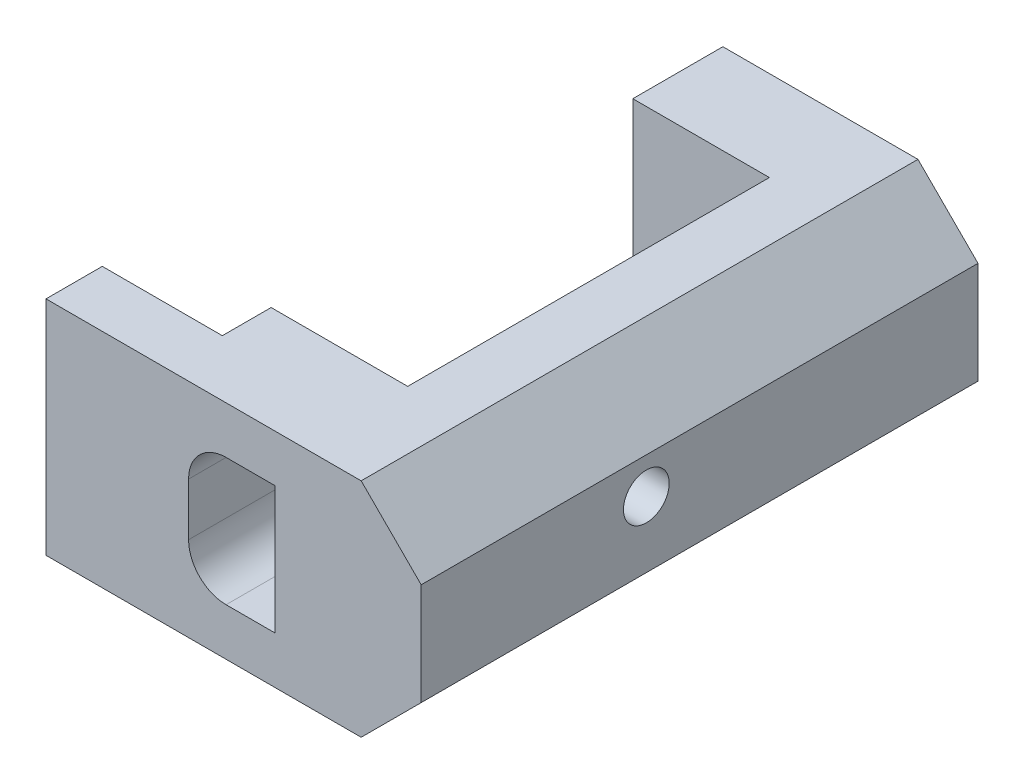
ISO-10303-21;
HEADER;
FILE_DESCRIPTION(('STEP AP214'),'2;1');
FILE_NAME('part.step','',(''),(''),'','','');
FILE_SCHEMA(('AUTOMOTIVE_DESIGN { 1 0 10303 214 1 1 1 1 }'));
ENDSEC;
DATA;
#1=APPLICATION_CONTEXT('core data for automotive mechanical design processes');
#2=APPLICATION_PROTOCOL_DEFINITION('international standard','automotive_design',2000,#1);
#3=PRODUCT_CONTEXT('',#1,'mechanical');
#4=PRODUCT('Part','Part','',(#3));
#5=PRODUCT_RELATED_PRODUCT_CATEGORY('part','',(#4));
#6=PRODUCT_DEFINITION_FORMATION('','',#4);
#7=PRODUCT_DEFINITION_CONTEXT('part definition',#1,'design');
#8=PRODUCT_DEFINITION('design','',#6,#7);
#9=PRODUCT_DEFINITION_SHAPE('','',#8);
#10=(LENGTH_UNIT() NAMED_UNIT(*) SI_UNIT(.MILLI.,.METRE.));
#11=(NAMED_UNIT(*) PLANE_ANGLE_UNIT() SI_UNIT($,.RADIAN.));
#12=(NAMED_UNIT(*) SI_UNIT($,.STERADIAN.) SOLID_ANGLE_UNIT());
#13=UNCERTAINTY_MEASURE_WITH_UNIT(LENGTH_MEASURE(1.E-05),#10,'distance_accuracy_value','');
#14=(GEOMETRIC_REPRESENTATION_CONTEXT(3) GLOBAL_UNCERTAINTY_ASSIGNED_CONTEXT((#13)) GLOBAL_UNIT_ASSIGNED_CONTEXT((#10,
#11,#12)) REPRESENTATION_CONTEXT('',''));
#15=CARTESIAN_POINT('',(0.,0.,0.));
#16=DIRECTION('',(0.,0.,1.));
#17=DIRECTION('',(1.,0.,0.));
#18=AXIS2_PLACEMENT_3D('',#15,#16,#17);
#19=CARTESIAN_POINT('',(0.,14.8,0.));
#20=DIRECTION('',(1.,0.,0.));
#21=DIRECTION('',(0.,0.,-1.));
#22=AXIS2_PLACEMENT_3D('',#19,#20,#21);
#23=PLANE('',#22);
#24=DIRECTION('',(0.,0.,1.));
#25=VECTOR('',#24,1.);
#26=CARTESIAN_POINT('',(0.,14.8,0.));
#27=LINE('',#26,#25);
#28=CARTESIAN_POINT('',(0.,14.8,-4.));
#29=VERTEX_POINT('',#28);
#30=CARTESIAN_POINT('',(0.,14.8,-0.750000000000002));
#31=VERTEX_POINT('',#30);
#32=EDGE_CURVE('E362',#29,#31,#27,.T.);
#33=ORIENTED_EDGE('',*,*,#32,.F.);
#34=DIRECTION('',(0.,1.,0.));
#35=VECTOR('',#34,1.);
#36=CARTESIAN_POINT('',(0.,14.8,-4.));
#37=LINE('',#36,#35);
#38=CARTESIAN_POINT('',(0.,0.,-4.));
#39=VERTEX_POINT('',#38);
#40=EDGE_CURVE('E220',#39,#29,#37,.T.);
#41=ORIENTED_EDGE('',*,*,#40,.F.);
#42=DIRECTION('',(0.,0.,1.));
#43=VECTOR('',#42,1.);
#44=CARTESIAN_POINT('',(0.,0.,0.));
#45=LINE('',#44,#43);
#46=CARTESIAN_POINT('',(0.,0.,-0.750000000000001));
#47=VERTEX_POINT('',#46);
#48=EDGE_CURVE('E351',#39,#47,#45,.T.);
#49=ORIENTED_EDGE('',*,*,#48,.T.);
#50=DIRECTION('',(0.,1.,0.));
#51=VECTOR('',#50,1.);
#52=CARTESIAN_POINT('',(0.,0.,-0.750000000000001));
#53=LINE('',#52,#51);
#54=EDGE_CURVE('E280',#47,#31,#53,.T.);
#55=ORIENTED_EDGE('',*,*,#54,.T.);
#56=EDGE_LOOP('',(#33,#41,#49,#55));
#57=FACE_BOUND('',#56,.T.);
#58=ADVANCED_FACE('F34',(#57),#23,.F.);
#59=CARTESIAN_POINT('',(0.,14.8,-33.1));
#60=DIRECTION('',(1.,0.,0.));
#61=DIRECTION('',(0.,0.,-1.));
#62=AXIS2_PLACEMENT_3D('',#59,#60,#61);
#63=PLANE('',#62);
#64=CARTESIAN_POINT('',(1.01164552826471E-13,8.4,-31.1));
#65=DIRECTION('',(-1.,0.,0.));
#66=DIRECTION('',(0.,0.,1.));
#67=AXIS2_PLACEMENT_3D('',#64,#65,#66);
#68=CIRCLE('',#67,1.);
#69=CARTESIAN_POINT('',(0.,8.4,-30.1));
#70=VERTEX_POINT('',#69);
#71=EDGE_CURVE('E245',#70,#70,#68,.T.);
#72=ORIENTED_EDGE('',*,*,#71,.F.);
#73=EDGE_LOOP('',(#72));
#74=FACE_BOUND('',#73,.T.);
#75=DIRECTION('',(0.,0.,1.));
#76=VECTOR('',#75,1.);
#77=CARTESIAN_POINT('',(0.,0.,-33.1));
#78=LINE('',#77,#76);
#79=CARTESIAN_POINT('',(0.,0.,-34.1));
#80=VERTEX_POINT('',#79);
#81=CARTESIAN_POINT('',(0.,0.,-28.1));
#82=VERTEX_POINT('',#81);
#83=EDGE_CURVE('E368',#80,#82,#78,.T.);
#84=ORIENTED_EDGE('',*,*,#83,.T.);
#85=DIRECTION('',(0.,-1.,0.));
#86=VECTOR('',#85,1.);
#87=CARTESIAN_POINT('',(0.,14.8,-28.1));
#88=LINE('',#87,#86);
#89=CARTESIAN_POINT('',(0.,14.8,-28.1));
#90=VERTEX_POINT('',#89);
#91=EDGE_CURVE('E374',#90,#82,#88,.T.);
#92=ORIENTED_EDGE('',*,*,#91,.F.);
#93=DIRECTION('',(0.,0.,1.));
#94=VECTOR('',#93,1.);
#95=CARTESIAN_POINT('',(0.,14.8,-33.1));
#96=LINE('',#95,#94);
#97=CARTESIAN_POINT('',(0.,14.8,-34.1));
#98=VERTEX_POINT('',#97);
#99=EDGE_CURVE('E364',#98,#90,#96,.T.);
#100=ORIENTED_EDGE('',*,*,#99,.F.);
#101=DIRECTION('',(0.,1.,0.));
#102=VECTOR('',#101,1.);
#103=CARTESIAN_POINT('',(0.,0.,-34.1));
#104=LINE('',#103,#102);
#105=EDGE_CURVE('E253',#80,#98,#104,.T.);
#106=ORIENTED_EDGE('',*,*,#105,.F.);
#107=EDGE_LOOP('',(#84,#92,#100,#106));
#108=FACE_BOUND('',#107,.T.);
#109=ADVANCED_FACE('F411',(#74,#108),#63,.F.);
#110=CARTESIAN_POINT('',(0.,14.8,-28.1));
#111=DIRECTION('',(0.,0.,-1.));
#112=DIRECTION('',(-1.,0.,0.));
#113=AXIS2_PLACEMENT_3D('',#110,#111,#112);
#114=PLANE('',#113);
#115=DIRECTION('',(1.,0.,0.));
#116=VECTOR('',#115,1.);
#117=CARTESIAN_POINT('',(0.,0.,-28.1));
#118=LINE('',#117,#116);
#119=CARTESIAN_POINT('',(9.09999999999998,0.,-28.1));
#120=VERTEX_POINT('',#119);
#121=EDGE_CURVE('E370',#82,#120,#118,.T.);
#122=ORIENTED_EDGE('',*,*,#121,.T.);
#123=DIRECTION('',(0.,-1.,0.));
#124=VECTOR('',#123,1.);
#125=CARTESIAN_POINT('',(9.09999999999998,14.8,-28.1));
#126=LINE('',#125,#124);
#127=CARTESIAN_POINT('',(9.09999999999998,14.8,-28.1));
#128=VERTEX_POINT('',#127);
#129=EDGE_CURVE('E206',#128,#120,#126,.T.);
#130=ORIENTED_EDGE('',*,*,#129,.F.);
#131=DIRECTION('',(1.,0.,0.));
#132=VECTOR('',#131,1.);
#133=CARTESIAN_POINT('',(0.,14.8,-28.1));
#134=LINE('',#133,#132);
#135=EDGE_CURVE('E202',#90,#128,#134,.T.);
#136=ORIENTED_EDGE('',*,*,#135,.F.);
#137=ORIENTED_EDGE('',*,*,#91,.T.);
#138=EDGE_LOOP('',(#122,#130,#136,#137));
#139=FACE_BOUND('',#138,.T.);
#140=ADVANCED_FACE('F431',(#139),#114,.F.);
#141=CARTESIAN_POINT('',(9.09999999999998,14.8,-5.));
#142=DIRECTION('',(1.,0.,0.));
#143=DIRECTION('',(0.,0.,-1.));
#144=AXIS2_PLACEMENT_3D('',#141,#142,#143);
#145=PLANE('',#144);
#146=DIRECTION('',(0.,-0.429835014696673,-0.902907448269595));
#147=VECTOR('',#146,1.);
#148=CARTESIAN_POINT('',(9.09999999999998,11.6896323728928,-11.7386212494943));
#149=LINE('',#148,#147);
#150=CARTESIAN_POINT('',(9.09999999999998,11.6896323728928,-11.7386212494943));
#151=VERTEX_POINT('',#150);
#152=CARTESIAN_POINT('',(9.09999999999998,10.2711768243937,-14.718215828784));
#153=VERTEX_POINT('',#152);
#154=EDGE_CURVE('E335',#151,#153,#149,.T.);
#155=ORIENTED_EDGE('',*,*,#154,.F.);
#156=DIRECTION('',(0.,0.567023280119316,-0.823701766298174));
#157=VECTOR('',#156,1.);
#158=CARTESIAN_POINT('',(9.09999999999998,9.81845554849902,-9.02040542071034));
#159=LINE('',#158,#157);
#160=CARTESIAN_POINT('',(9.09999999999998,9.81845554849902,-9.02040542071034));
#161=VERTEX_POINT('',#160);
#162=EDGE_CURVE('E313',#161,#151,#159,.T.);
#163=ORIENTED_EDGE('',*,*,#162,.F.);
#164=DIRECTION('',(0.,0.996858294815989,0.0792056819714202));
#165=VECTOR('',#164,1.);
#166=CARTESIAN_POINT('',(9.09999999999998,6.52882317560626,-9.28178417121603));
#167=LINE('',#166,#165);
#168=CARTESIAN_POINT('',(9.09999999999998,6.52882317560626,-9.28178417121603));
#169=VERTEX_POINT('',#168);
#170=EDGE_CURVE('E318',#169,#161,#167,.T.);
#171=ORIENTED_EDGE('',*,*,#170,.F.);
#172=DIRECTION('',(0.,0.429835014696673,0.902907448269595));
#173=VECTOR('',#172,1.);
#174=CARTESIAN_POINT('',(9.09999999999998,5.11036762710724,-12.2613787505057));
#175=LINE('',#174,#173);
#176=CARTESIAN_POINT('',(9.09999999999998,5.11036762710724,-12.2613787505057));
#177=VERTEX_POINT('',#176);
#178=EDGE_CURVE('E344',#177,#169,#175,.T.);
#179=ORIENTED_EDGE('',*,*,#178,.F.);
#180=DIRECTION('',(0.,-0.567023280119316,0.823701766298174));
#181=VECTOR('',#180,1.);
#182=CARTESIAN_POINT('',(9.09999999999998,6.98154445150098,-14.9795945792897));
#183=LINE('',#182,#181);
#184=CARTESIAN_POINT('',(9.09999999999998,6.98154445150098,-14.9795945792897));
#185=VERTEX_POINT('',#184);
#186=EDGE_CURVE('E341',#185,#177,#183,.T.);
#187=ORIENTED_EDGE('',*,*,#186,.F.);
#188=DIRECTION('',(0.,-0.99685829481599,-0.0792056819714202));
#189=VECTOR('',#188,1.);
#190=CARTESIAN_POINT('',(9.09999999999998,10.2711768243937,-14.718215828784));
#191=LINE('',#190,#189);
#192=EDGE_CURVE('E338',#153,#185,#191,.T.);
#193=ORIENTED_EDGE('',*,*,#192,.F.);
#194=EDGE_LOOP('',(#155,#163,#171,#179,#187,#193));
#195=FACE_BOUND('',#194,.T.);
#196=DIRECTION('',(0.,0.,1.));
#197=VECTOR('',#196,1.);
#198=CARTESIAN_POINT('',(9.09999999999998,0.,-5.));
#199=LINE('',#198,#197);
#200=CARTESIAN_POINT('',(9.09999999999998,0.,-4.));
#201=VERTEX_POINT('',#200);
#202=EDGE_CURVE('E212',#120,#201,#199,.T.);
#203=ORIENTED_EDGE('',*,*,#202,.T.);
#204=DIRECTION('',(0.,-1.,0.));
#205=VECTOR('',#204,1.);
#206=CARTESIAN_POINT('',(9.09999999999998,0.,-4.));
#207=LINE('',#206,#205);
#208=CARTESIAN_POINT('',(9.09999999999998,14.8,-4.));
#209=VERTEX_POINT('',#208);
#210=EDGE_CURVE('E209',#209,#201,#207,.T.);
#211=ORIENTED_EDGE('',*,*,#210,.F.);
#212=DIRECTION('',(0.,0.,1.));
#213=VECTOR('',#212,1.);
#214=CARTESIAN_POINT('',(9.09999999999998,14.8,-5.));
#215=LINE('',#214,#213);
#216=EDGE_CURVE('E195',#128,#209,#215,.T.);
#217=ORIENTED_EDGE('',*,*,#216,.F.);
#218=ORIENTED_EDGE('',*,*,#129,.T.);
#219=EDGE_LOOP('',(#203,#211,#217,#218));
#220=FACE_BOUND('',#219,.T.);
#221=ADVANCED_FACE('F210',(#195,#220),#145,.F.);
#222=CARTESIAN_POINT('',(0.,14.8,0.));
#223=DIRECTION('',(0.,-1.,0.));
#224=DIRECTION('',(0.,0.,-1.));
#225=AXIS2_PLACEMENT_3D('',#222,#223,#224);
#226=PLANE('',#225);
#227=DIRECTION('',(-1.,0.,0.));
#228=VECTOR('',#227,1.);
#229=CARTESIAN_POINT('',(0.,14.8,3.));
#230=LINE('',#229,#228);
#231=CARTESIAN_POINT('',(13.,14.8,3.));
#232=VERTEX_POINT('',#231);
#233=CARTESIAN_POINT('',(-7.99999999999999,14.8,3.00000000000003));
#234=VERTEX_POINT('',#233);
#235=EDGE_CURVE('E309',#232,#234,#230,.T.);
#236=ORIENTED_EDGE('',*,*,#235,.F.);
#237=DIRECTION('',(0.,0.,-1.));
#238=VECTOR('',#237,1.);
#239=CARTESIAN_POINT('',(13.,14.8,0.));
#240=LINE('',#239,#238);
#241=CARTESIAN_POINT('',(13.,14.8,-34.1));
#242=VERTEX_POINT('',#241);
#243=EDGE_CURVE('E11',#232,#242,#240,.T.);
#244=ORIENTED_EDGE('',*,*,#243,.T.);
#245=DIRECTION('',(1.,0.,0.));
#246=VECTOR('',#245,1.);
#247=CARTESIAN_POINT('',(0.,14.8,-34.1));
#248=LINE('',#247,#246);
#249=EDGE_CURVE('E256',#98,#242,#248,.T.);
#250=ORIENTED_EDGE('',*,*,#249,.F.);
#251=ORIENTED_EDGE('',*,*,#99,.T.);
#252=ORIENTED_EDGE('',*,*,#135,.T.);
#253=ORIENTED_EDGE('',*,*,#216,.T.);
#254=DIRECTION('',(1.,0.,0.));
#255=VECTOR('',#254,1.);
#256=CARTESIAN_POINT('',(9.09999999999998,14.8,-4.));
#257=LINE('',#256,#255);
#258=EDGE_CURVE('E199',#29,#209,#257,.T.);
#259=ORIENTED_EDGE('',*,*,#258,.F.);
#260=ORIENTED_EDGE('',*,*,#32,.T.);
#261=DIRECTION('',(1.,0.,0.));
#262=VECTOR('',#261,1.);
#263=CARTESIAN_POINT('',(-8.,14.8,-0.749999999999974));
#264=LINE('',#263,#262);
#265=CARTESIAN_POINT('',(-8.,14.8,-0.749999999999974));
#266=VERTEX_POINT('',#265);
#267=EDGE_CURVE('E301',#266,#31,#264,.T.);
#268=ORIENTED_EDGE('',*,*,#267,.F.);
#269=DIRECTION('',(0.,0.,-1.));
#270=VECTOR('',#269,1.);
#271=CARTESIAN_POINT('',(-8.,14.8,0.));
#272=LINE('',#271,#270);
#273=EDGE_CURVE('E299',#234,#266,#272,.T.);
#274=ORIENTED_EDGE('',*,*,#273,.F.);
#275=EDGE_LOOP('',(#236,#244,#250,#251,#252,#253,#259,#260,#268,#274));
#276=FACE_BOUND('',#275,.T.);
#277=ADVANCED_FACE('F197',(#276),#226,.F.);
#278=CARTESIAN_POINT('',(0.,0.,0.));
#279=DIRECTION('',(0.,-1.,0.));
#280=DIRECTION('',(0.,0.,-1.));
#281=AXIS2_PLACEMENT_3D('',#278,#279,#280);
#282=PLANE('',#281);
#283=DIRECTION('',(-1.,0.,0.));
#284=VECTOR('',#283,1.);
#285=CARTESIAN_POINT('',(0.,0.,-34.1));
#286=LINE('',#285,#284);
#287=CARTESIAN_POINT('',(13.,0.,-34.1));
#288=VERTEX_POINT('',#287);
#289=EDGE_CURVE('E249',#288,#80,#286,.T.);
#290=ORIENTED_EDGE('',*,*,#289,.F.);
#291=DIRECTION('',(0.,0.,1.));
#292=VECTOR('',#291,1.);
#293=CARTESIAN_POINT('',(13.,0.,3.));
#294=LINE('',#293,#292);
#295=CARTESIAN_POINT('',(13.,0.,3.));
#296=VERTEX_POINT('',#295);
#297=EDGE_CURVE('E57',#288,#296,#294,.T.);
#298=ORIENTED_EDGE('',*,*,#297,.T.);
#299=DIRECTION('',(1.,0.,0.));
#300=VECTOR('',#299,1.);
#301=CARTESIAN_POINT('',(0.,0.,3.));
#302=LINE('',#301,#300);
#303=CARTESIAN_POINT('',(-7.99999999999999,0.,3.00000000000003));
#304=VERTEX_POINT('',#303);
#305=EDGE_CURVE('E311',#304,#296,#302,.T.);
#306=ORIENTED_EDGE('',*,*,#305,.F.);
#307=DIRECTION('',(0.,0.,1.));
#308=VECTOR('',#307,1.);
#309=CARTESIAN_POINT('',(-8.,0.,0.));
#310=LINE('',#309,#308);
#311=CARTESIAN_POINT('',(-8.,0.,-0.749999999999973));
#312=VERTEX_POINT('',#311);
#313=EDGE_CURVE('E293',#312,#304,#310,.T.);
#314=ORIENTED_EDGE('',*,*,#313,.F.);
#315=DIRECTION('',(1.,0.,0.));
#316=VECTOR('',#315,1.);
#317=CARTESIAN_POINT('',(-8.,0.,-0.749999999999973));
#318=LINE('',#317,#316);
#319=EDGE_CURVE('E306',#312,#47,#318,.T.);
#320=ORIENTED_EDGE('',*,*,#319,.T.);
#321=ORIENTED_EDGE('',*,*,#48,.F.);
#322=DIRECTION('',(-1.,0.,0.));
#323=VECTOR('',#322,1.);
#324=CARTESIAN_POINT('',(0.,0.,-4.));
#325=LINE('',#324,#323);
#326=EDGE_CURVE('E215',#201,#39,#325,.T.);
#327=ORIENTED_EDGE('',*,*,#326,.F.);
#328=ORIENTED_EDGE('',*,*,#202,.F.);
#329=ORIENTED_EDGE('',*,*,#121,.F.);
#330=ORIENTED_EDGE('',*,*,#83,.F.);
#331=EDGE_LOOP('',(#290,#298,#306,#314,#320,#321,#327,#328,#329,#330));
#332=FACE_BOUND('',#331,.T.);
#333=ADVANCED_FACE('F406',(#332),#282,.T.);
#334=CARTESIAN_POINT('',(11.6,0.,0.));
#335=DIRECTION('',(-1.,0.,0.));
#336=DIRECTION('',(0.,0.,1.));
#337=AXIS2_PLACEMENT_3D('',#334,#335,#336);
#338=PLANE('',#337);
#339=CARTESIAN_POINT('',(11.6,8.4,-12.));
#340=DIRECTION('',(-1.,0.,0.));
#341=DIRECTION('',(0.,0.,1.));
#342=AXIS2_PLACEMENT_3D('',#339,#340,#341);
#343=CIRCLE('',#342,1.525);
#344=CARTESIAN_POINT('',(11.6,8.4,-10.475));
#345=VERTEX_POINT('',#344);
#346=EDGE_CURVE('E401',#345,#345,#343,.T.);
#347=ORIENTED_EDGE('',*,*,#346,.F.);
#348=EDGE_LOOP('',(#347));
#349=FACE_BOUND('',#348,.T.);
#350=DIRECTION('',(0.,0.567023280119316,-0.823701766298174));
#351=VECTOR('',#350,1.);
#352=CARTESIAN_POINT('',(11.6,9.81845554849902,-9.02040542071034));
#353=LINE('',#352,#351);
#354=CARTESIAN_POINT('',(11.6,9.81845554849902,-9.02040542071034));
#355=VERTEX_POINT('',#354);
#356=CARTESIAN_POINT('',(11.6,11.6896323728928,-11.7386212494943));
#357=VERTEX_POINT('',#356);
#358=EDGE_CURVE('E314',#355,#357,#353,.T.);
#359=ORIENTED_EDGE('',*,*,#358,.T.);
#360=DIRECTION('',(0.,-0.429835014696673,-0.902907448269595));
#361=VECTOR('',#360,1.);
#362=CARTESIAN_POINT('',(11.6,11.6896323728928,-11.7386212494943));
#363=LINE('',#362,#361);
#364=CARTESIAN_POINT('',(11.6,10.2711768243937,-14.718215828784));
#365=VERTEX_POINT('',#364);
#366=EDGE_CURVE('E317',#357,#365,#363,.T.);
#367=ORIENTED_EDGE('',*,*,#366,.T.);
#368=DIRECTION('',(0.,-0.99685829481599,-0.0792056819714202));
#369=VECTOR('',#368,1.);
#370=CARTESIAN_POINT('',(11.6,10.2711768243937,-14.718215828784));
#371=LINE('',#370,#369);
#372=CARTESIAN_POINT('',(11.6,6.98154445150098,-14.9795945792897));
#373=VERTEX_POINT('',#372);
#374=EDGE_CURVE('E321',#365,#373,#371,.T.);
#375=ORIENTED_EDGE('',*,*,#374,.T.);
#376=DIRECTION('',(0.,-0.567023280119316,0.823701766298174));
#377=VECTOR('',#376,1.);
#378=CARTESIAN_POINT('',(11.6,6.98154445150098,-14.9795945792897));
#379=LINE('',#378,#377);
#380=CARTESIAN_POINT('',(11.6,5.11036762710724,-12.2613787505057));
#381=VERTEX_POINT('',#380);
#382=EDGE_CURVE('E324',#373,#381,#379,.T.);
#383=ORIENTED_EDGE('',*,*,#382,.T.);
#384=DIRECTION('',(0.,0.429835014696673,0.902907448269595));
#385=VECTOR('',#384,1.);
#386=CARTESIAN_POINT('',(11.6,5.11036762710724,-12.2613787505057));
#387=LINE('',#386,#385);
#388=CARTESIAN_POINT('',(11.6,6.52882317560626,-9.28178417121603));
#389=VERTEX_POINT('',#388);
#390=EDGE_CURVE('E327',#381,#389,#387,.T.);
#391=ORIENTED_EDGE('',*,*,#390,.T.);
#392=DIRECTION('',(0.,0.996858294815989,0.0792056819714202));
#393=VECTOR('',#392,1.);
#394=CARTESIAN_POINT('',(11.6,6.52882317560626,-9.28178417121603));
#395=LINE('',#394,#393);
#396=EDGE_CURVE('E330',#389,#355,#395,.T.);
#397=ORIENTED_EDGE('',*,*,#396,.T.);
#398=EDGE_LOOP('',(#359,#367,#375,#383,#391,#397));
#399=FACE_BOUND('',#398,.T.);
#400=ADVANCED_FACE('F443',(#349,#399),#338,.T.);
#401=CARTESIAN_POINT('',(11.6,9.81845554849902,-9.02040542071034));
#402=DIRECTION('',(0.,0.823701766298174,0.567023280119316));
#403=DIRECTION('',(0.,-0.567023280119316,0.823701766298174));
#404=AXIS2_PLACEMENT_3D('',#401,#402,#403);
#405=PLANE('',#404);
#406=ORIENTED_EDGE('',*,*,#162,.T.);
#407=DIRECTION('',(-1.,0.,0.));
#408=VECTOR('',#407,1.);
#409=CARTESIAN_POINT('',(11.6,11.6896323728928,-11.7386212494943));
#410=LINE('',#409,#408);
#411=EDGE_CURVE('E333',#357,#151,#410,.T.);
#412=ORIENTED_EDGE('',*,*,#411,.F.);
#413=ORIENTED_EDGE('',*,*,#358,.F.);
#414=DIRECTION('',(-1.,0.,0.));
#415=VECTOR('',#414,1.);
#416=CARTESIAN_POINT('',(11.6,9.81845554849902,-9.02040542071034));
#417=LINE('',#416,#415);
#418=EDGE_CURVE('E349',#355,#161,#417,.T.);
#419=ORIENTED_EDGE('',*,*,#418,.T.);
#420=EDGE_LOOP('',(#406,#412,#413,#419));
#421=FACE_BOUND('',#420,.T.);
#422=ADVANCED_FACE('F446',(#421),#405,.F.);
#423=CARTESIAN_POINT('',(11.6,6.52882317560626,-9.28178417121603));
#424=DIRECTION('',(0.,-0.0792056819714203,0.996858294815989));
#425=DIRECTION('',(0.,-0.99685829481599,-0.0792056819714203));
#426=AXIS2_PLACEMENT_3D('',#423,#424,#425);
#427=PLANE('',#426);
#428=ORIENTED_EDGE('',*,*,#170,.T.);
#429=ORIENTED_EDGE('',*,*,#418,.F.);
#430=ORIENTED_EDGE('',*,*,#396,.F.);
#431=DIRECTION('',(-1.,0.,0.));
#432=VECTOR('',#431,1.);
#433=CARTESIAN_POINT('',(11.6,6.52882317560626,-9.28178417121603));
#434=LINE('',#433,#432);
#435=EDGE_CURVE('E352',#389,#169,#434,.T.);
#436=ORIENTED_EDGE('',*,*,#435,.T.);
#437=EDGE_LOOP('',(#428,#429,#430,#436));
#438=FACE_BOUND('',#437,.T.);
#439=ADVANCED_FACE('F449',(#438),#427,.F.);
#440=CARTESIAN_POINT('',(11.6,5.11036762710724,-12.2613787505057));
#441=DIRECTION('',(0.,-0.902907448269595,0.429835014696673));
#442=DIRECTION('',(0.,-0.429835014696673,-0.902907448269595));
#443=AXIS2_PLACEMENT_3D('',#440,#441,#442);
#444=PLANE('',#443);
#445=ORIENTED_EDGE('',*,*,#178,.T.);
#446=ORIENTED_EDGE('',*,*,#435,.F.);
#447=ORIENTED_EDGE('',*,*,#390,.F.);
#448=DIRECTION('',(-1.,0.,0.));
#449=VECTOR('',#448,1.);
#450=CARTESIAN_POINT('',(11.6,5.11036762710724,-12.2613787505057));
#451=LINE('',#450,#449);
#452=EDGE_CURVE('E354',#381,#177,#451,.T.);
#453=ORIENTED_EDGE('',*,*,#452,.T.);
#454=EDGE_LOOP('',(#445,#446,#447,#453));
#455=FACE_BOUND('',#454,.T.);
#456=ADVANCED_FACE('F462',(#455),#444,.F.);
#457=CARTESIAN_POINT('',(11.6,6.98154445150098,-14.9795945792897));
#458=DIRECTION('',(0.,-0.823701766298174,-0.567023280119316));
#459=DIRECTION('',(0.,0.567023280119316,-0.823701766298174));
#460=AXIS2_PLACEMENT_3D('',#457,#458,#459);
#461=PLANE('',#460);
#462=ORIENTED_EDGE('',*,*,#186,.T.);
#463=ORIENTED_EDGE('',*,*,#452,.F.);
#464=ORIENTED_EDGE('',*,*,#382,.F.);
#465=DIRECTION('',(-1.,0.,0.));
#466=VECTOR('',#465,1.);
#467=CARTESIAN_POINT('',(11.6,6.98154445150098,-14.9795945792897));
#468=LINE('',#467,#466);
#469=EDGE_CURVE('E356',#373,#185,#468,.T.);
#470=ORIENTED_EDGE('',*,*,#469,.T.);
#471=EDGE_LOOP('',(#462,#463,#464,#470));
#472=FACE_BOUND('',#471,.T.);
#473=ADVANCED_FACE('F458',(#472),#461,.F.);
#474=CARTESIAN_POINT('',(11.6,10.2711768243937,-14.718215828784));
#475=DIRECTION('',(0.,0.0792056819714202,-0.99685829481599));
#476=DIRECTION('',(0.,0.99685829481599,0.0792056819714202));
#477=AXIS2_PLACEMENT_3D('',#474,#475,#476);
#478=PLANE('',#477);
#479=ORIENTED_EDGE('',*,*,#192,.T.);
#480=ORIENTED_EDGE('',*,*,#469,.F.);
#481=ORIENTED_EDGE('',*,*,#374,.F.);
#482=DIRECTION('',(-1.,0.,0.));
#483=VECTOR('',#482,1.);
#484=CARTESIAN_POINT('',(11.6,10.2711768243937,-14.718215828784));
#485=LINE('',#484,#483);
#486=EDGE_CURVE('E358',#365,#153,#485,.T.);
#487=ORIENTED_EDGE('',*,*,#486,.T.);
#488=EDGE_LOOP('',(#479,#480,#481,#487));
#489=FACE_BOUND('',#488,.T.);
#490=ADVANCED_FACE('F454',(#489),#478,.F.);
#491=CARTESIAN_POINT('',(11.6,11.6896323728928,-11.7386212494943));
#492=DIRECTION('',(0.,0.902907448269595,-0.429835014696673));
#493=DIRECTION('',(0.,0.429835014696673,0.902907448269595));
#494=AXIS2_PLACEMENT_3D('',#491,#492,#493);
#495=PLANE('',#494);
#496=ORIENTED_EDGE('',*,*,#154,.T.);
#497=ORIENTED_EDGE('',*,*,#486,.F.);
#498=ORIENTED_EDGE('',*,*,#366,.F.);
#499=ORIENTED_EDGE('',*,*,#411,.T.);
#500=EDGE_LOOP('',(#496,#497,#498,#499));
#501=FACE_BOUND('',#500,.T.);
#502=ADVANCED_FACE('F451',(#501),#495,.F.);
#503=CARTESIAN_POINT('',(0.,0.,3.));
#504=DIRECTION('',(0.,0.,1.));
#505=DIRECTION('',(1.,0.,0.));
#506=AXIS2_PLACEMENT_3D('',#503,#504,#505);
#507=PLANE('',#506);
#508=CARTESIAN_POINT('',(4.,9.15,3.));
#509=DIRECTION('',(0.,0.,1.));
#510=DIRECTION('',(1.,0.,0.));
#511=AXIS2_PLACEMENT_3D('',#508,#509,#510);
#512=CIRCLE('',#511,2.5);
#513=CARTESIAN_POINT('',(4.,11.65,3.));
#514=VERTEX_POINT('',#513);
#515=CARTESIAN_POINT('',(1.5,9.15,3.));
#516=VERTEX_POINT('',#515);
#517=EDGE_CURVE('E259',#514,#516,#512,.T.);
#518=ORIENTED_EDGE('',*,*,#517,.F.);
#519=DIRECTION('',(-1.,0.,0.));
#520=VECTOR('',#519,1.);
#521=CARTESIAN_POINT('',(7.25,11.65,3.));
#522=LINE('',#521,#520);
#523=CARTESIAN_POINT('',(7.25,11.65,3.));
#524=VERTEX_POINT('',#523);
#525=EDGE_CURVE('E274',#524,#514,#522,.T.);
#526=ORIENTED_EDGE('',*,*,#525,.F.);
#527=DIRECTION('',(0.,1.,0.));
#528=VECTOR('',#527,1.);
#529=CARTESIAN_POINT('',(7.25,11.65,3.));
#530=LINE('',#529,#528);
#531=CARTESIAN_POINT('',(7.25,3.15,3.));
#532=VERTEX_POINT('',#531);
#533=EDGE_CURVE('E271',#532,#524,#530,.T.);
#534=ORIENTED_EDGE('',*,*,#533,.F.);
#535=DIRECTION('',(1.,0.,0.));
#536=VECTOR('',#535,1.);
#537=CARTESIAN_POINT('',(7.25,3.15,3.));
#538=LINE('',#537,#536);
#539=CARTESIAN_POINT('',(4.,3.15,3.));
#540=VERTEX_POINT('',#539);
#541=EDGE_CURVE('E268',#540,#532,#538,.T.);
#542=ORIENTED_EDGE('',*,*,#541,.F.);
#543=CARTESIAN_POINT('',(4.,5.65,3.));
#544=DIRECTION('',(0.,0.,1.));
#545=DIRECTION('',(1.,0.,0.));
#546=AXIS2_PLACEMENT_3D('',#543,#544,#545);
#547=CIRCLE('',#546,2.5);
#548=CARTESIAN_POINT('',(1.5,5.65,3.));
#549=VERTEX_POINT('',#548);
#550=EDGE_CURVE('E265',#549,#540,#547,.T.);
#551=ORIENTED_EDGE('',*,*,#550,.F.);
#552=DIRECTION('',(0.,-1.,0.));
#553=VECTOR('',#552,1.);
#554=CARTESIAN_POINT('',(1.5,9.15,3.));
#555=LINE('',#554,#553);
#556=EDGE_CURVE('E262',#516,#549,#555,.T.);
#557=ORIENTED_EDGE('',*,*,#556,.F.);
#558=EDGE_LOOP('',(#518,#526,#534,#542,#551,#557));
#559=FACE_BOUND('',#558,.T.);
#560=ORIENTED_EDGE('',*,*,#305,.T.);
#561=DIRECTION('',(0.707106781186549,0.707106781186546,0.));
#562=VECTOR('',#561,1.);
#563=CARTESIAN_POINT('',(6.49999999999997,-6.49999999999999,3.));
#564=LINE('',#563,#562);
#565=CARTESIAN_POINT('',(17.,4.,3.));
#566=VERTEX_POINT('',#565);
#567=EDGE_CURVE('E42',#296,#566,#564,.T.);
#568=ORIENTED_EDGE('',*,*,#567,.T.);
#569=DIRECTION('',(0.,-1.,0.));
#570=VECTOR('',#569,1.);
#571=CARTESIAN_POINT('',(17.,0.,3.));
#572=LINE('',#571,#570);
#573=CARTESIAN_POINT('',(17.,10.8,3.));
#574=VERTEX_POINT('',#573);
#575=EDGE_CURVE('E224',#574,#566,#572,.T.);
#576=ORIENTED_EDGE('',*,*,#575,.F.);
#577=DIRECTION('',(0.707106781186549,-0.707106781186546,0.));
#578=VECTOR('',#577,1.);
#579=CARTESIAN_POINT('',(13.9,13.9,3.));
#580=LINE('',#579,#578);
#581=EDGE_CURVE('E49',#574,#232,#580,.F.);
#582=ORIENTED_EDGE('',*,*,#581,.T.);
#583=ORIENTED_EDGE('',*,*,#235,.T.);
#584=DIRECTION('',(0.,1.,0.));
#585=VECTOR('',#584,1.);
#586=CARTESIAN_POINT('',(-7.99999999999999,0.,3.00000000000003));
#587=LINE('',#586,#585);
#588=EDGE_CURVE('E296',#304,#234,#587,.T.);
#589=ORIENTED_EDGE('',*,*,#588,.F.);
#590=EDGE_LOOP('',(#560,#568,#576,#582,#583,#589));
#591=FACE_BOUND('',#590,.T.);
#592=ADVANCED_FACE('F393',(#559,#591),#507,.T.);
#593=CARTESIAN_POINT('',(-8.,0.,-0.749999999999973));
#594=DIRECTION('',(0.,0.,-1.));
#595=DIRECTION('',(-1.,0.,0.));
#596=AXIS2_PLACEMENT_3D('',#593,#594,#595);
#597=PLANE('',#596);
#598=ORIENTED_EDGE('',*,*,#54,.F.);
#599=ORIENTED_EDGE('',*,*,#319,.F.);
#600=DIRECTION('',(0.,1.,0.));
#601=VECTOR('',#600,1.);
#602=CARTESIAN_POINT('',(-8.,0.,-0.749999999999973));
#603=LINE('',#602,#601);
#604=EDGE_CURVE('E290',#312,#266,#603,.T.);
#605=ORIENTED_EDGE('',*,*,#604,.T.);
#606=ORIENTED_EDGE('',*,*,#267,.T.);
#607=EDGE_LOOP('',(#598,#599,#605,#606));
#608=FACE_BOUND('',#607,.T.);
#609=ADVANCED_FACE('F475',(#608),#597,.T.);
#610=CARTESIAN_POINT('',(-8.,0.,0.));
#611=DIRECTION('',(-1.,0.,0.));
#612=DIRECTION('',(0.,0.,1.));
#613=AXIS2_PLACEMENT_3D('',#610,#611,#612);
#614=PLANE('',#613);
#615=ORIENTED_EDGE('',*,*,#604,.F.);
#616=ORIENTED_EDGE('',*,*,#313,.T.);
#617=ORIENTED_EDGE('',*,*,#588,.T.);
#618=ORIENTED_EDGE('',*,*,#273,.T.);
#619=EDGE_LOOP('',(#615,#616,#617,#618));
#620=FACE_BOUND('',#619,.T.);
#621=ADVANCED_FACE('F479',(#620),#614,.T.);
#622=CARTESIAN_POINT('',(4.,9.15,-5.));
#623=DIRECTION('',(0.,0.,1.));
#624=DIRECTION('',(1.,0.,0.));
#625=AXIS2_PLACEMENT_3D('',#622,#623,#624);
#626=CYLINDRICAL_SURFACE('',#625,2.5);
#627=DIRECTION('',(0.,0.,1.));
#628=VECTOR('',#627,1.);
#629=CARTESIAN_POINT('',(1.5,9.15,-5.));
#630=LINE('',#629,#628);
#631=CARTESIAN_POINT('',(1.5,9.15,-4.));
#632=VERTEX_POINT('',#631);
#633=EDGE_CURVE('E277',#632,#516,#630,.T.);
#634=ORIENTED_EDGE('',*,*,#633,.F.);
#635=CARTESIAN_POINT('',(4.,9.15,-4.));
#636=DIRECTION('',(0.,0.,1.));
#637=DIRECTION('',(1.,0.,0.));
#638=AXIS2_PLACEMENT_3D('',#635,#636,#637);
#639=CIRCLE('',#638,2.5);
#640=CARTESIAN_POINT('',(4.,11.65,-4.));
#641=VERTEX_POINT('',#640);
#642=EDGE_CURVE('E242',#632,#641,#639,.F.);
#643=ORIENTED_EDGE('',*,*,#642,.T.);
#644=DIRECTION('',(0.,0.,1.));
#645=VECTOR('',#644,1.);
#646=CARTESIAN_POINT('',(4.,11.65,-5.));
#647=LINE('',#646,#645);
#648=EDGE_CURVE('E278',#641,#514,#647,.T.);
#649=ORIENTED_EDGE('',*,*,#648,.T.);
#650=ORIENTED_EDGE('',*,*,#517,.T.);
#651=EDGE_LOOP('',(#634,#643,#649,#650));
#652=FACE_BOUND('',#651,.T.);
#653=ADVANCED_FACE('F483',(#652),#626,.F.);
#654=CARTESIAN_POINT('',(7.25,11.65,-5.));
#655=DIRECTION('',(0.,1.,0.));
#656=DIRECTION('',(0.,0.,1.));
#657=AXIS2_PLACEMENT_3D('',#654,#655,#656);
#658=PLANE('',#657);
#659=ORIENTED_EDGE('',*,*,#648,.F.);
#660=DIRECTION('',(1.,0.,0.));
#661=VECTOR('',#660,1.);
#662=CARTESIAN_POINT('',(7.25,11.65,-4.));
#663=LINE('',#662,#661);
#664=CARTESIAN_POINT('',(7.25,11.65,-4.));
#665=VERTEX_POINT('',#664);
#666=EDGE_CURVE('E239',#641,#665,#663,.T.);
#667=ORIENTED_EDGE('',*,*,#666,.T.);
#668=DIRECTION('',(0.,0.,1.));
#669=VECTOR('',#668,1.);
#670=CARTESIAN_POINT('',(7.25,11.65,-5.));
#671=LINE('',#670,#669);
#672=EDGE_CURVE('E281',#665,#524,#671,.T.);
#673=ORIENTED_EDGE('',*,*,#672,.T.);
#674=ORIENTED_EDGE('',*,*,#525,.T.);
#675=EDGE_LOOP('',(#659,#667,#673,#674));
#676=FACE_BOUND('',#675,.T.);
#677=ADVANCED_FACE('F487',(#676),#658,.F.);
#678=CARTESIAN_POINT('',(7.25,11.65,-5.));
#679=DIRECTION('',(1.,0.,0.));
#680=DIRECTION('',(0.,0.,-1.));
#681=AXIS2_PLACEMENT_3D('',#678,#679,#680);
#682=PLANE('',#681);
#683=ORIENTED_EDGE('',*,*,#672,.F.);
#684=DIRECTION('',(0.,-1.,0.));
#685=VECTOR('',#684,1.);
#686=CARTESIAN_POINT('',(7.25,11.65,-4.));
#687=LINE('',#686,#685);
#688=CARTESIAN_POINT('',(7.25,3.15,-4.));
#689=VERTEX_POINT('',#688);
#690=EDGE_CURVE('E236',#665,#689,#687,.T.);
#691=ORIENTED_EDGE('',*,*,#690,.T.);
#692=DIRECTION('',(0.,0.,1.));
#693=VECTOR('',#692,1.);
#694=CARTESIAN_POINT('',(7.25,3.15,-5.));
#695=LINE('',#694,#693);
#696=EDGE_CURVE('E283',#689,#532,#695,.T.);
#697=ORIENTED_EDGE('',*,*,#696,.T.);
#698=ORIENTED_EDGE('',*,*,#533,.T.);
#699=EDGE_LOOP('',(#683,#691,#697,#698));
#700=FACE_BOUND('',#699,.T.);
#701=ADVANCED_FACE('F500',(#700),#682,.F.);
#702=CARTESIAN_POINT('',(7.25,3.15,-5.));
#703=DIRECTION('',(0.,-1.,0.));
#704=DIRECTION('',(1.,0.,0.));
#705=AXIS2_PLACEMENT_3D('',#702,#703,#704);
#706=PLANE('',#705);
#707=ORIENTED_EDGE('',*,*,#696,.F.);
#708=DIRECTION('',(-1.,0.,0.));
#709=VECTOR('',#708,1.);
#710=CARTESIAN_POINT('',(7.25,3.15,-4.));
#711=LINE('',#710,#709);
#712=CARTESIAN_POINT('',(4.,3.15,-4.));
#713=VERTEX_POINT('',#712);
#714=EDGE_CURVE('E233',#689,#713,#711,.T.);
#715=ORIENTED_EDGE('',*,*,#714,.T.);
#716=DIRECTION('',(0.,0.,1.));
#717=VECTOR('',#716,1.);
#718=CARTESIAN_POINT('',(4.,3.15,-5.));
#719=LINE('',#718,#717);
#720=EDGE_CURVE('E285',#713,#540,#719,.T.);
#721=ORIENTED_EDGE('',*,*,#720,.T.);
#722=ORIENTED_EDGE('',*,*,#541,.T.);
#723=EDGE_LOOP('',(#707,#715,#721,#722));
#724=FACE_BOUND('',#723,.T.);
#725=ADVANCED_FACE('F496',(#724),#706,.F.);
#726=CARTESIAN_POINT('',(4.,5.65,-5.));
#727=DIRECTION('',(0.,0.,1.));
#728=DIRECTION('',(1.,0.,0.));
#729=AXIS2_PLACEMENT_3D('',#726,#727,#728);
#730=CYLINDRICAL_SURFACE('',#729,2.5);
#731=ORIENTED_EDGE('',*,*,#720,.F.);
#732=CARTESIAN_POINT('',(4.,5.65,-4.));
#733=DIRECTION('',(0.,0.,1.));
#734=DIRECTION('',(1.,0.,0.));
#735=AXIS2_PLACEMENT_3D('',#732,#733,#734);
#736=CIRCLE('',#735,2.5);
#737=CARTESIAN_POINT('',(1.5,5.65,-4.));
#738=VERTEX_POINT('',#737);
#739=EDGE_CURVE('E230',#713,#738,#736,.F.);
#740=ORIENTED_EDGE('',*,*,#739,.T.);
#741=DIRECTION('',(0.,0.,1.));
#742=VECTOR('',#741,1.);
#743=CARTESIAN_POINT('',(1.5,5.65,-5.));
#744=LINE('',#743,#742);
#745=EDGE_CURVE('E287',#738,#549,#744,.T.);
#746=ORIENTED_EDGE('',*,*,#745,.T.);
#747=ORIENTED_EDGE('',*,*,#550,.T.);
#748=EDGE_LOOP('',(#731,#740,#746,#747));
#749=FACE_BOUND('',#748,.T.);
#750=ADVANCED_FACE('F492',(#749),#730,.F.);
#751=CARTESIAN_POINT('',(1.5,9.15,-5.));
#752=DIRECTION('',(-1.,0.,0.));
#753=DIRECTION('',(0.,-1.,0.));
#754=AXIS2_PLACEMENT_3D('',#751,#752,#753);
#755=PLANE('',#754);
#756=ORIENTED_EDGE('',*,*,#745,.F.);
#757=DIRECTION('',(0.,1.,0.));
#758=VECTOR('',#757,1.);
#759=CARTESIAN_POINT('',(1.5,9.15,-4.));
#760=LINE('',#759,#758);
#761=EDGE_CURVE('E377',#738,#632,#760,.T.);
#762=ORIENTED_EDGE('',*,*,#761,.T.);
#763=ORIENTED_EDGE('',*,*,#633,.T.);
#764=ORIENTED_EDGE('',*,*,#556,.T.);
#765=EDGE_LOOP('',(#756,#762,#763,#764));
#766=FACE_BOUND('',#765,.T.);
#767=ADVANCED_FACE('F489',(#766),#755,.F.);
#768=CARTESIAN_POINT('',(0.,0.,-34.1));
#769=DIRECTION('',(0.,0.,-1.));
#770=DIRECTION('',(-1.,0.,0.));
#771=AXIS2_PLACEMENT_3D('',#768,#769,#770);
#772=PLANE('',#771);
#773=DIRECTION('',(0.,1.,0.));
#774=VECTOR('',#773,1.);
#775=CARTESIAN_POINT('',(17.,14.8,-34.1));
#776=LINE('',#775,#774);
#777=CARTESIAN_POINT('',(17.,4.,-34.1));
#778=VERTEX_POINT('',#777);
#779=CARTESIAN_POINT('',(17.,10.8,-34.1));
#780=VERTEX_POINT('',#779);
#781=EDGE_CURVE('E221',#778,#780,#776,.T.);
#782=ORIENTED_EDGE('',*,*,#781,.F.);
#783=DIRECTION('',(-0.707106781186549,-0.707106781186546,0.));
#784=VECTOR('',#783,1.);
#785=CARTESIAN_POINT('',(6.49999999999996,-6.5,-34.1));
#786=LINE('',#785,#784);
#787=EDGE_CURVE('E388',#778,#288,#786,.T.);
#788=ORIENTED_EDGE('',*,*,#787,.T.);
#789=ORIENTED_EDGE('',*,*,#289,.T.);
#790=ORIENTED_EDGE('',*,*,#105,.T.);
#791=ORIENTED_EDGE('',*,*,#249,.T.);
#792=DIRECTION('',(-0.707106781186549,0.707106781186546,0.));
#793=VECTOR('',#792,1.);
#794=CARTESIAN_POINT('',(13.9,13.9,-34.1));
#795=LINE('',#794,#793);
#796=EDGE_CURVE('E386',#242,#780,#795,.F.);
#797=ORIENTED_EDGE('',*,*,#796,.T.);
#798=EDGE_LOOP('',(#782,#788,#789,#790,#791,#797));
#799=FACE_BOUND('',#798,.T.);
#800=ADVANCED_FACE('F404',(#799),#772,.T.);
#801=CARTESIAN_POINT('',(6.0000000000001,8.4,-31.1));
#802=DIRECTION('',(-1.,0.,0.));
#803=DIRECTION('',(0.,0.,1.));
#804=AXIS2_PLACEMENT_3D('',#801,#802,#803);
#805=CYLINDRICAL_SURFACE('',#804,1.);
#806=CARTESIAN_POINT('',(6.0000000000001,8.4,-31.1));
#807=DIRECTION('',(-1.,0.,0.));
#808=DIRECTION('',(0.,0.,1.));
#809=AXIS2_PLACEMENT_3D('',#806,#807,#808);
#810=CIRCLE('',#809,1.);
#811=CARTESIAN_POINT('',(6.0000000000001,8.4,-30.1));
#812=VERTEX_POINT('',#811);
#813=EDGE_CURVE('E246',#812,#812,#810,.T.);
#814=ORIENTED_EDGE('',*,*,#813,.F.);
#815=EDGE_LOOP('',(#814));
#816=FACE_BOUND('',#815,.T.);
#817=ORIENTED_EDGE('',*,*,#71,.T.);
#818=EDGE_LOOP('',(#817));
#819=FACE_BOUND('',#818,.T.);
#820=ADVANCED_FACE('F510',(#816,#819),#805,.F.);
#821=CARTESIAN_POINT('',(6.0000000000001,8.4,-31.1));
#822=DIRECTION('',(-1.,0.,0.));
#823=DIRECTION('',(0.,0.,1.));
#824=AXIS2_PLACEMENT_3D('',#821,#822,#823);
#825=PLANE('',#824);
#826=ORIENTED_EDGE('',*,*,#813,.T.);
#827=EDGE_LOOP('',(#826));
#828=FACE_BOUND('',#827,.T.);
#829=ADVANCED_FACE('F513',(#828),#825,.T.);
#830=CARTESIAN_POINT('',(0.,0.,-4.));
#831=DIRECTION('',(0.,0.,1.));
#832=DIRECTION('',(1.,0.,0.));
#833=AXIS2_PLACEMENT_3D('',#830,#831,#832);
#834=PLANE('',#833);
#835=ORIENTED_EDGE('',*,*,#258,.T.);
#836=ORIENTED_EDGE('',*,*,#210,.T.);
#837=ORIENTED_EDGE('',*,*,#326,.T.);
#838=ORIENTED_EDGE('',*,*,#40,.T.);
#839=EDGE_LOOP('',(#835,#836,#837,#838));
#840=FACE_BOUND('',#839,.T.);
#841=ORIENTED_EDGE('',*,*,#761,.F.);
#842=ORIENTED_EDGE('',*,*,#739,.F.);
#843=ORIENTED_EDGE('',*,*,#714,.F.);
#844=ORIENTED_EDGE('',*,*,#690,.F.);
#845=ORIENTED_EDGE('',*,*,#666,.F.);
#846=ORIENTED_EDGE('',*,*,#642,.F.);
#847=EDGE_LOOP('',(#841,#842,#843,#844,#845,#846));
#848=FACE_BOUND('',#847,.T.);
#849=ADVANCED_FACE('F217',(#840,#848),#834,.F.);
#850=CARTESIAN_POINT('',(17.,0.,0.));
#851=DIRECTION('',(-1.,0.,0.));
#852=DIRECTION('',(0.,0.,1.));
#853=AXIS2_PLACEMENT_3D('',#850,#851,#852);
#854=PLANE('',#853);
#855=CARTESIAN_POINT('',(17.,8.4,-12.));
#856=DIRECTION('',(1.,0.,0.));
#857=DIRECTION('',(0.,0.,-1.));
#858=AXIS2_PLACEMENT_3D('',#855,#856,#857);
#859=CIRCLE('',#858,1.525);
#860=CARTESIAN_POINT('',(17.,8.4,-13.525));
#861=VERTEX_POINT('',#860);
#862=EDGE_CURVE('E526',#861,#861,#859,.T.);
#863=ORIENTED_EDGE('',*,*,#862,.F.);
#864=EDGE_LOOP('',(#863));
#865=FACE_BOUND('',#864,.T.);
#866=ORIENTED_EDGE('',*,*,#575,.T.);
#867=DIRECTION('',(0.,0.,-1.));
#868=VECTOR('',#867,1.);
#869=CARTESIAN_POINT('',(17.,4.,-34.1));
#870=LINE('',#869,#868);
#871=EDGE_CURVE('E383',#566,#778,#870,.T.);
#872=ORIENTED_EDGE('',*,*,#871,.T.);
#873=ORIENTED_EDGE('',*,*,#781,.T.);
#874=DIRECTION('',(0.,0.,1.));
#875=VECTOR('',#874,1.);
#876=CARTESIAN_POINT('',(17.,10.8,0.));
#877=LINE('',#876,#875);
#878=EDGE_CURVE('E380',#780,#574,#877,.T.);
#879=ORIENTED_EDGE('',*,*,#878,.T.);
#880=EDGE_LOOP('',(#866,#872,#873,#879));
#881=FACE_BOUND('',#880,.T.);
#882=ADVANCED_FACE('F398',(#865,#881),#854,.F.);
#883=CARTESIAN_POINT('',(17.,4.,0.));
#884=DIRECTION('',(0.707106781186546,-0.707106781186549,0.));
#885=DIRECTION('',(0.,0.,1.));
#886=AXIS2_PLACEMENT_3D('',#883,#884,#885);
#887=PLANE('',#886);
#888=ORIENTED_EDGE('',*,*,#567,.F.);
#889=ORIENTED_EDGE('',*,*,#297,.F.);
#890=ORIENTED_EDGE('',*,*,#787,.F.);
#891=ORIENTED_EDGE('',*,*,#871,.F.);
#892=EDGE_LOOP('',(#888,#889,#890,#891));
#893=FACE_BOUND('',#892,.T.);
#894=ADVANCED_FACE('F402',(#893),#887,.T.);
#895=CARTESIAN_POINT('',(17.,10.8,0.));
#896=DIRECTION('',(-0.707106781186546,-0.707106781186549,0.));
#897=DIRECTION('',(0.,0.,1.));
#898=AXIS2_PLACEMENT_3D('',#895,#896,#897);
#899=PLANE('',#898);
#900=ORIENTED_EDGE('',*,*,#796,.F.);
#901=ORIENTED_EDGE('',*,*,#243,.F.);
#902=ORIENTED_EDGE('',*,*,#581,.F.);
#903=ORIENTED_EDGE('',*,*,#878,.F.);
#904=EDGE_LOOP('',(#900,#901,#902,#903));
#905=FACE_BOUND('',#904,.T.);
#906=ADVANCED_FACE('F36',(#905),#899,.F.);
#907=CARTESIAN_POINT('',(-8.,8.4,-12.));
#908=DIRECTION('',(1.,0.,0.));
#909=DIRECTION('',(0.,0.,-1.));
#910=AXIS2_PLACEMENT_3D('',#907,#908,#909);
#911=CYLINDRICAL_SURFACE('',#910,1.525);
#912=ORIENTED_EDGE('',*,*,#346,.T.);
#913=EDGE_LOOP('',(#912));
#914=FACE_BOUND('',#913,.T.);
#915=ORIENTED_EDGE('',*,*,#862,.T.);
#916=EDGE_LOOP('',(#915));
#917=FACE_BOUND('',#916,.T.);
#918=ADVANCED_FACE('F418',(#914,#917),#911,.F.);
#919=CLOSED_SHELL('',(#58,#109,#140,#221,#277,#333,#400,#422,#439,#456,#473,#490,#502,#592,#609,
#621,#653,#677,#701,#725,#750,#767,#800,#820,#829,#849,#882,#894,#906,#918));
#920=MANIFOLD_SOLID_BREP('B2',#919);
#921=ADVANCED_BREP_SHAPE_REPRESENTATION('',(#18,#920),#14);
#922=SHAPE_DEFINITION_REPRESENTATION(#9,#921);
ENDSEC;
END-ISO-10303-21;
